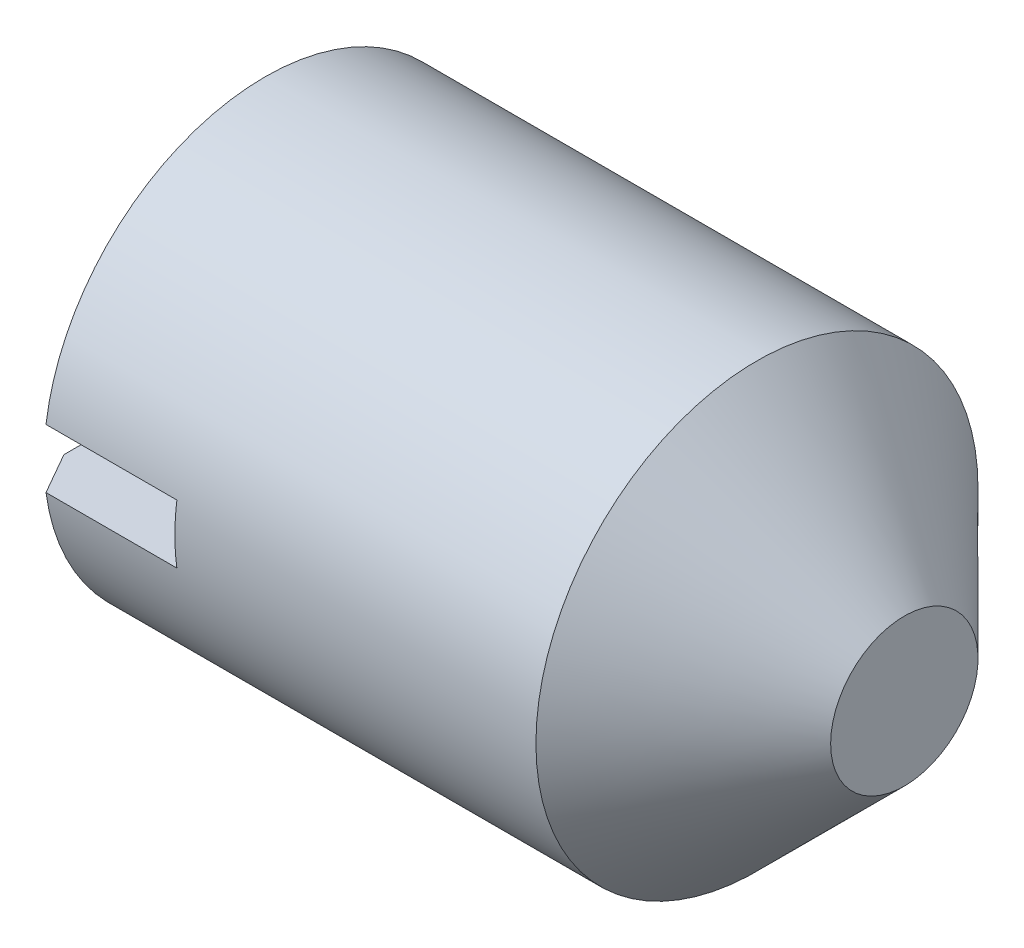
from build123d import *

# Parameters (mm, degrees)
SKETCH2_W                    = 3
SKETCH2_H                    = 0.4
SLOT_DEPTH                   = 1.05
ENL_V_MAT_EXTRU_1_DEPTH      = 6.431390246
ENL_V_MAT_EXTRU_1_DEPTH_BACK = 6.431390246
ESQUISSE1_W                  = 0.922934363
ESQUISSE1_H                  = 1.901467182


with BuildPart() as part:
    # BodySke → BaseBody (revolve)
    with BuildSketch(Plane.XY, mode=Mode.PRIVATE) as basebody_sk:
        Polygon((0, 0), (0, 1.2195), (0.161946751, 1.5), (3.5, 1.5), (5, 0), align=None)
    revolve(basebody_sk.sketch.rotate(Axis((-12.7, 0, 0), (1, 0, 0)), 90), axis=Axis((-12.7, 0, 0), (1, 0, 0)))

    # Sketch2 → Slot (cut)
    with BuildSketch(Plane.ZY):
        Rectangle(SKETCH2_W, SKETCH2_H)
    extrude(amount=-SLOT_DEPTH, mode=Mode.SUBTRACT)

    # Esquisse1 → Enl_v. mat.-Extru.1 (cut, two sides: drawn at the far end of the back side and taken through both)
    with BuildSketch(Plane(origin=(0, 0, 0), x_dir=(1, 0, 0), z_dir=(0, 1, 0)).offset(-ENL_V_MAT_EXTRU_1_DEPTH_BACK)):
        with Locations((4.961467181, -0.061158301)):
            Rectangle(ESQUISSE1_W, ESQUISSE1_H)
    extrude(amount=ENL_V_MAT_EXTRU_1_DEPTH + ENL_V_MAT_EXTRU_1_DEPTH_BACK, mode=Mode.SUBTRACT)


solid = part.part
